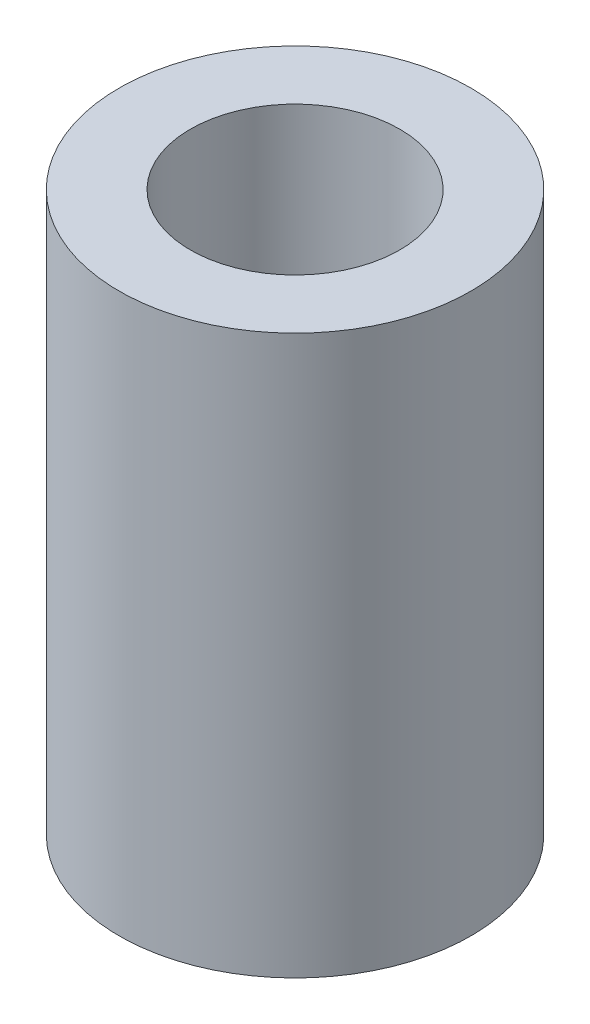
ISO-10303-21;
HEADER;
FILE_DESCRIPTION(('STEP AP214'),'2;1');
FILE_NAME('part.step','',(''),(''),'','','');
FILE_SCHEMA(('AUTOMOTIVE_DESIGN { 1 0 10303 214 1 1 1 1 }'));
ENDSEC;
DATA;
#1=APPLICATION_CONTEXT('core data for automotive mechanical design processes');
#2=APPLICATION_PROTOCOL_DEFINITION('international standard','automotive_design',2000,#1);
#3=PRODUCT_CONTEXT('',#1,'mechanical');
#4=PRODUCT('Part','Part','',(#3));
#5=PRODUCT_RELATED_PRODUCT_CATEGORY('part','',(#4));
#6=PRODUCT_DEFINITION_FORMATION('','',#4);
#7=PRODUCT_DEFINITION_CONTEXT('part definition',#1,'design');
#8=PRODUCT_DEFINITION('design','',#6,#7);
#9=PRODUCT_DEFINITION_SHAPE('','',#8);
#10=(LENGTH_UNIT() NAMED_UNIT(*) SI_UNIT(.MILLI.,.METRE.));
#11=(NAMED_UNIT(*) PLANE_ANGLE_UNIT() SI_UNIT($,.RADIAN.));
#12=(NAMED_UNIT(*) SI_UNIT($,.STERADIAN.) SOLID_ANGLE_UNIT());
#13=UNCERTAINTY_MEASURE_WITH_UNIT(LENGTH_MEASURE(1.E-05),#10,'distance_accuracy_value','');
#14=(GEOMETRIC_REPRESENTATION_CONTEXT(3) GLOBAL_UNCERTAINTY_ASSIGNED_CONTEXT((#13)) GLOBAL_UNIT_ASSIGNED_CONTEXT((#10,
#11,#12)) REPRESENTATION_CONTEXT('',''));
#15=CARTESIAN_POINT('',(0.,0.,0.));
#16=DIRECTION('',(0.,0.,1.));
#17=DIRECTION('',(1.,0.,0.));
#18=AXIS2_PLACEMENT_3D('',#15,#16,#17);
#19=CARTESIAN_POINT('',(0.,0.,0.));
#20=DIRECTION('',(0.,-1.,0.));
#21=DIRECTION('',(0.,0.,-1.));
#22=AXIS2_PLACEMENT_3D('',#19,#20,#21);
#23=CYLINDRICAL_SURFACE('',#22,2.38125);
#24=CARTESIAN_POINT('',(0.,0.,0.));
#25=DIRECTION('',(0.,-1.,0.));
#26=DIRECTION('',(0.,0.,-1.));
#27=AXIS2_PLACEMENT_3D('',#24,#25,#26);
#28=CIRCLE('',#27,2.38125);
#29=CARTESIAN_POINT('',(0.,0.,-2.38125));
#30=VERTEX_POINT('',#29);
#31=EDGE_CURVE('E45',#30,#30,#28,.T.);
#32=ORIENTED_EDGE('',*,*,#31,.T.);
#33=EDGE_LOOP('',(#32));
#34=FACE_BOUND('',#33,.T.);
#35=CARTESIAN_POINT('',(0.,12.7,0.));
#36=DIRECTION('',(0.,-1.,0.));
#37=DIRECTION('',(0.,0.,-1.));
#38=AXIS2_PLACEMENT_3D('',#35,#36,#37);
#39=CIRCLE('',#38,2.38125);
#40=CARTESIAN_POINT('',(0.,12.7,-2.38125));
#41=VERTEX_POINT('',#40);
#42=EDGE_CURVE('E10',#41,#41,#39,.T.);
#43=ORIENTED_EDGE('',*,*,#42,.F.);
#44=EDGE_LOOP('',(#43));
#45=FACE_BOUND('',#44,.T.);
#46=ADVANCED_FACE('F31',(#34,#45),#23,.F.);
#47=CARTESIAN_POINT('',(2.38125,12.7,0.));
#48=DIRECTION('',(0.,1.,0.));
#49=DIRECTION('',(0.,0.,1.));
#50=AXIS2_PLACEMENT_3D('',#47,#48,#49);
#51=PLANE('',#50);
#52=ORIENTED_EDGE('',*,*,#42,.T.);
#53=EDGE_LOOP('',(#52));
#54=FACE_BOUND('',#53,.T.);
#55=CARTESIAN_POINT('',(0.,12.7,0.));
#56=DIRECTION('',(0.,-1.,0.));
#57=DIRECTION('',(0.,0.,-1.));
#58=AXIS2_PLACEMENT_3D('',#55,#56,#57);
#59=CIRCLE('',#58,4.0005);
#60=CARTESIAN_POINT('',(0.,12.7,-4.0005));
#61=VERTEX_POINT('',#60);
#62=EDGE_CURVE('E37',#61,#61,#59,.T.);
#63=ORIENTED_EDGE('',*,*,#62,.F.);
#64=EDGE_LOOP('',(#63));
#65=FACE_BOUND('',#64,.T.);
#66=ADVANCED_FACE('F61',(#54,#65),#51,.T.);
#67=CARTESIAN_POINT('',(0.,0.,0.));
#68=DIRECTION('',(0.,-1.,0.));
#69=DIRECTION('',(0.,0.,-1.));
#70=AXIS2_PLACEMENT_3D('',#67,#68,#69);
#71=CYLINDRICAL_SURFACE('',#70,4.0005);
#72=ORIENTED_EDGE('',*,*,#62,.T.);
#73=EDGE_LOOP('',(#72));
#74=FACE_BOUND('',#73,.T.);
#75=CARTESIAN_POINT('',(0.,0.,0.));
#76=DIRECTION('',(0.,-1.,0.));
#77=DIRECTION('',(0.,0.,-1.));
#78=AXIS2_PLACEMENT_3D('',#75,#76,#77);
#79=CIRCLE('',#78,4.0005);
#80=CARTESIAN_POINT('',(0.,0.,-4.0005));
#81=VERTEX_POINT('',#80);
#82=EDGE_CURVE('E41',#81,#81,#79,.T.);
#83=ORIENTED_EDGE('',*,*,#82,.F.);
#84=EDGE_LOOP('',(#83));
#85=FACE_BOUND('',#84,.T.);
#86=ADVANCED_FACE('F55',(#74,#85),#71,.T.);
#87=CARTESIAN_POINT('',(2.38125,0.,0.));
#88=DIRECTION('',(0.,-1.,0.));
#89=DIRECTION('',(0.,0.,-1.));
#90=AXIS2_PLACEMENT_3D('',#87,#88,#89);
#91=PLANE('',#90);
#92=ORIENTED_EDGE('',*,*,#82,.T.);
#93=EDGE_LOOP('',(#92));
#94=FACE_BOUND('',#93,.T.);
#95=ORIENTED_EDGE('',*,*,#31,.F.);
#96=EDGE_LOOP('',(#95));
#97=FACE_BOUND('',#96,.T.);
#98=ADVANCED_FACE('F53',(#94,#97),#91,.T.);
#99=CLOSED_SHELL('',(#46,#66,#86,#98));
#100=MANIFOLD_SOLID_BREP('B2',#99);
#101=ADVANCED_BREP_SHAPE_REPRESENTATION('',(#18,#100),#14);
#102=SHAPE_DEFINITION_REPRESENTATION(#9,#101);
ENDSEC;
END-ISO-10303-21;
